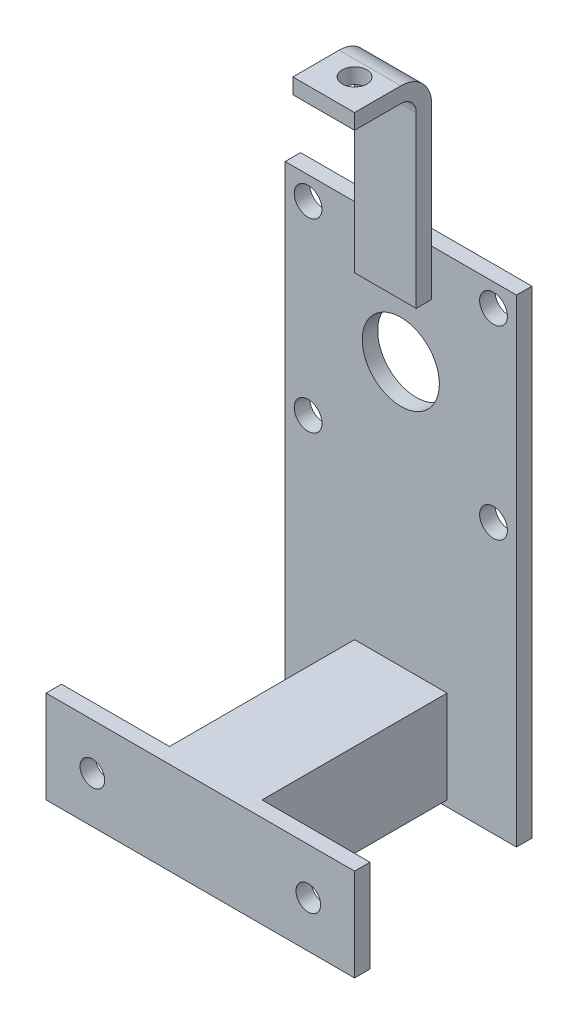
ISO-10303-21;
HEADER;
FILE_DESCRIPTION(('STEP AP214'),'2;1');
FILE_NAME('part.step','',(''),(''),'','','');
FILE_SCHEMA(('AUTOMOTIVE_DESIGN { 1 0 10303 214 1 1 1 1 }'));
ENDSEC;
DATA;
#1=APPLICATION_CONTEXT('core data for automotive mechanical design processes');
#2=APPLICATION_PROTOCOL_DEFINITION('international standard','automotive_design',2000,#1);
#3=PRODUCT_CONTEXT('',#1,'mechanical');
#4=PRODUCT('Part','Part','',(#3));
#5=PRODUCT_RELATED_PRODUCT_CATEGORY('part','',(#4));
#6=PRODUCT_DEFINITION_FORMATION('','',#4);
#7=PRODUCT_DEFINITION_CONTEXT('part definition',#1,'design');
#8=PRODUCT_DEFINITION('design','',#6,#7);
#9=PRODUCT_DEFINITION_SHAPE('','',#8);
#10=(LENGTH_UNIT() NAMED_UNIT(*) SI_UNIT(.MILLI.,.METRE.));
#11=(NAMED_UNIT(*) PLANE_ANGLE_UNIT() SI_UNIT($,.RADIAN.));
#12=(NAMED_UNIT(*) SI_UNIT($,.STERADIAN.) SOLID_ANGLE_UNIT());
#13=UNCERTAINTY_MEASURE_WITH_UNIT(LENGTH_MEASURE(1.E-05),#10,'distance_accuracy_value','');
#14=(GEOMETRIC_REPRESENTATION_CONTEXT(3) GLOBAL_UNCERTAINTY_ASSIGNED_CONTEXT((#13)) GLOBAL_UNIT_ASSIGNED_CONTEXT((#10,
#11,#12)) REPRESENTATION_CONTEXT('',''));
#15=CARTESIAN_POINT('',(0.,0.,0.));
#16=DIRECTION('',(0.,0.,1.));
#17=DIRECTION('',(1.,0.,0.));
#18=AXIS2_PLACEMENT_3D('',#15,#16,#17);
#19=CARTESIAN_POINT('',(0.,155.,5.));
#20=DIRECTION('',(0.,0.,-1.));
#21=DIRECTION('',(-1.,0.,0.));
#22=AXIS2_PLACEMENT_3D('',#19,#20,#21);
#23=PLANE('',#22);
#24=CARTESIAN_POINT('',(37.5,117.5,5.));
#25=DIRECTION('',(0.,0.,1.));
#26=DIRECTION('',(1.,0.,0.));
#27=AXIS2_PLACEMENT_3D('',#24,#25,#26);
#28=CIRCLE('',#27,12.5);
#29=CARTESIAN_POINT('',(50.,117.5,5.));
#30=VERTEX_POINT('',#29);
#31=EDGE_CURVE('E494',#30,#30,#28,.T.);
#32=ORIENTED_EDGE('',*,*,#31,.F.);
#33=EDGE_LOOP('',(#32));
#34=FACE_BOUND('',#33,.T.);
#35=CARTESIAN_POINT('',(67.5520382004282,147.552038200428,5.));
#36=DIRECTION('',(0.,0.,1.));
#37=DIRECTION('',(1.,0.,0.));
#38=AXIS2_PLACEMENT_3D('',#35,#36,#37);
#39=CIRCLE('',#38,4.50000000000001);
#40=CARTESIAN_POINT('',(72.0520382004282,147.552038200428,5.));
#41=VERTEX_POINT('',#40);
#42=EDGE_CURVE('E629',#41,#41,#39,.T.);
#43=ORIENTED_EDGE('',*,*,#42,.F.);
#44=EDGE_LOOP('',(#43));
#45=FACE_BOUND('',#44,.T.);
#46=CARTESIAN_POINT('',(7.44796179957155,147.552038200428,5.));
#47=DIRECTION('',(0.,0.,1.));
#48=DIRECTION('',(0.,1.,0.));
#49=AXIS2_PLACEMENT_3D('',#46,#47,#48);
#50=CIRCLE('',#49,4.50000000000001);
#51=CARTESIAN_POINT('',(7.44796179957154,152.052038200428,5.));
#52=VERTEX_POINT('',#51);
#53=EDGE_CURVE('E625',#52,#52,#50,.T.);
#54=ORIENTED_EDGE('',*,*,#53,.F.);
#55=EDGE_LOOP('',(#54));
#56=FACE_BOUND('',#55,.T.);
#57=CARTESIAN_POINT('',(7.44796179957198,87.4479617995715,5.));
#58=DIRECTION('',(0.,0.,1.));
#59=DIRECTION('',(-1.,0.,0.));
#60=AXIS2_PLACEMENT_3D('',#57,#58,#59);
#61=CIRCLE('',#60,4.50000000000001);
#62=CARTESIAN_POINT('',(2.94796179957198,87.4479617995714,5.));
#63=VERTEX_POINT('',#62);
#64=EDGE_CURVE('E621',#63,#63,#61,.T.);
#65=ORIENTED_EDGE('',*,*,#64,.F.);
#66=EDGE_LOOP('',(#65));
#67=FACE_BOUND('',#66,.T.);
#68=CARTESIAN_POINT('',(67.5520382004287,87.4479617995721,5.));
#69=DIRECTION('',(0.,0.,1.));
#70=DIRECTION('',(0.,-1.,0.));
#71=AXIS2_PLACEMENT_3D('',#68,#69,#70);
#72=CIRCLE('',#71,4.50000000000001);
#73=CARTESIAN_POINT('',(67.5520382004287,82.9479617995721,5.));
#74=VERTEX_POINT('',#73);
#75=EDGE_CURVE('E613',#74,#74,#72,.T.);
#76=ORIENTED_EDGE('',*,*,#75,.F.);
#77=EDGE_LOOP('',(#76));
#78=FACE_BOUND('',#77,.T.);
#79=DIRECTION('',(0.,1.,0.));
#80=VECTOR('',#79,1.);
#81=CARTESIAN_POINT('',(47.5,140.,5.));
#82=LINE('',#81,#80);
#83=CARTESIAN_POINT('',(47.5,140.,5.));
#84=VERTEX_POINT('',#83);
#85=CARTESIAN_POINT('',(47.5,155.,5.));
#86=VERTEX_POINT('',#85);
#87=EDGE_CURVE('E573',#84,#86,#82,.T.);
#88=ORIENTED_EDGE('',*,*,#87,.F.);
#89=DIRECTION('',(1.,0.,0.));
#90=VECTOR('',#89,1.);
#91=CARTESIAN_POINT('',(47.5,140.,5.));
#92=LINE('',#91,#90);
#93=CARTESIAN_POINT('',(27.5,140.,5.));
#94=VERTEX_POINT('',#93);
#95=EDGE_CURVE('E528',#94,#84,#92,.T.);
#96=ORIENTED_EDGE('',*,*,#95,.F.);
#97=DIRECTION('',(0.,-1.,0.));
#98=VECTOR('',#97,1.);
#99=CARTESIAN_POINT('',(27.5,140.,5.));
#100=LINE('',#99,#98);
#101=CARTESIAN_POINT('',(27.5,155.,5.));
#102=VERTEX_POINT('',#101);
#103=EDGE_CURVE('E522',#102,#94,#100,.T.);
#104=ORIENTED_EDGE('',*,*,#103,.F.);
#105=DIRECTION('',(-1.,0.,0.));
#106=VECTOR('',#105,1.);
#107=CARTESIAN_POINT('',(0.,155.,5.));
#108=LINE('',#107,#106);
#109=CARTESIAN_POINT('',(0.,155.,5.));
#110=VERTEX_POINT('',#109);
#111=EDGE_CURVE('E507',#102,#110,#108,.T.);
#112=ORIENTED_EDGE('',*,*,#111,.T.);
#113=DIRECTION('',(0.,-1.,0.));
#114=VECTOR('',#113,1.);
#115=CARTESIAN_POINT('',(0.,0.,5.));
#116=LINE('',#115,#114);
#117=CARTESIAN_POINT('',(0.,0.,5.));
#118=VERTEX_POINT('',#117);
#119=EDGE_CURVE('E500',#110,#118,#116,.T.);
#120=ORIENTED_EDGE('',*,*,#119,.T.);
#121=DIRECTION('',(1.,0.,0.));
#122=VECTOR('',#121,1.);
#123=CARTESIAN_POINT('',(0.,0.,5.));
#124=LINE('',#123,#122);
#125=CARTESIAN_POINT('',(75.,0.,5.));
#126=VERTEX_POINT('',#125);
#127=EDGE_CURVE('E503',#118,#126,#124,.T.);
#128=ORIENTED_EDGE('',*,*,#127,.T.);
#129=DIRECTION('',(0.,1.,0.));
#130=VECTOR('',#129,1.);
#131=CARTESIAN_POINT('',(75.,0.,5.));
#132=LINE('',#131,#130);
#133=CARTESIAN_POINT('',(75.,155.,5.));
#134=VERTEX_POINT('',#133);
#135=EDGE_CURVE('E505',#126,#134,#132,.T.);
#136=ORIENTED_EDGE('',*,*,#135,.T.);
#137=EDGE_CURVE('E508',#134,#86,#108,.T.);
#138=ORIENTED_EDGE('',*,*,#137,.T.);
#139=EDGE_LOOP('',(#88,#96,#104,#112,#120,#128,#136,#138));
#140=FACE_BOUND('',#139,.T.);
#141=DIRECTION('',(0.,-1.,0.));
#142=VECTOR('',#141,1.);
#143=CARTESIAN_POINT('',(22.5,32.,5.));
#144=LINE('',#143,#142);
#145=CARTESIAN_POINT('',(22.5,32.,5.));
#146=VERTEX_POINT('',#145);
#147=CARTESIAN_POINT('',(22.5,2.,5.));
#148=VERTEX_POINT('',#147);
#149=EDGE_CURVE('E351',#146,#148,#144,.T.);
#150=ORIENTED_EDGE('',*,*,#149,.F.);
#151=DIRECTION('',(-1.,0.,0.));
#152=VECTOR('',#151,1.);
#153=CARTESIAN_POINT('',(22.5,32.,5.));
#154=LINE('',#153,#152);
#155=CARTESIAN_POINT('',(52.5,32.,5.));
#156=VERTEX_POINT('',#155);
#157=EDGE_CURVE('E356',#156,#146,#154,.T.);
#158=ORIENTED_EDGE('',*,*,#157,.F.);
#159=DIRECTION('',(0.,1.,0.));
#160=VECTOR('',#159,1.);
#161=CARTESIAN_POINT('',(52.5,32.,5.));
#162=LINE('',#161,#160);
#163=CARTESIAN_POINT('',(52.5,2.,5.));
#164=VERTEX_POINT('',#163);
#165=EDGE_CURVE('E48',#164,#156,#162,.T.);
#166=ORIENTED_EDGE('',*,*,#165,.F.);
#167=DIRECTION('',(1.,0.,0.));
#168=VECTOR('',#167,1.);
#169=CARTESIAN_POINT('',(22.5,2.,5.));
#170=LINE('',#169,#168);
#171=EDGE_CURVE('E43',#148,#164,#170,.T.);
#172=ORIENTED_EDGE('',*,*,#171,.F.);
#173=EDGE_LOOP('',(#150,#158,#166,#172));
#174=FACE_BOUND('',#173,.T.);
#175=ADVANCED_FACE('F25',(#34,#45,#56,#67,#78,#140,#174),#23,.F.);
#176=CARTESIAN_POINT('',(0.,0.,5.));
#177=DIRECTION('',(1.,0.,0.));
#178=DIRECTION('',(0.,0.,-1.));
#179=AXIS2_PLACEMENT_3D('',#176,#177,#178);
#180=PLANE('',#179);
#181=DIRECTION('',(0.,-1.,0.));
#182=VECTOR('',#181,1.);
#183=CARTESIAN_POINT('',(0.,0.,0.));
#184=LINE('',#183,#182);
#185=CARTESIAN_POINT('',(0.,155.,0.));
#186=VERTEX_POINT('',#185);
#187=CARTESIAN_POINT('',(0.,0.,0.));
#188=VERTEX_POINT('',#187);
#189=EDGE_CURVE('E484',#186,#188,#184,.T.);
#190=ORIENTED_EDGE('',*,*,#189,.T.);
#191=DIRECTION('',(0.,0.,-1.));
#192=VECTOR('',#191,1.);
#193=CARTESIAN_POINT('',(0.,0.,5.));
#194=LINE('',#193,#192);
#195=EDGE_CURVE('E520',#118,#188,#194,.T.);
#196=ORIENTED_EDGE('',*,*,#195,.F.);
#197=ORIENTED_EDGE('',*,*,#119,.F.);
#198=DIRECTION('',(0.,0.,-1.));
#199=VECTOR('',#198,1.);
#200=CARTESIAN_POINT('',(0.,155.,5.));
#201=LINE('',#200,#199);
#202=EDGE_CURVE('E511',#110,#186,#201,.T.);
#203=ORIENTED_EDGE('',*,*,#202,.T.);
#204=EDGE_LOOP('',(#190,#196,#197,#203));
#205=FACE_BOUND('',#204,.T.);
#206=ADVANCED_FACE('F27',(#205),#180,.F.);
#207=CARTESIAN_POINT('',(0.,0.,5.));
#208=DIRECTION('',(0.,1.,0.));
#209=DIRECTION('',(0.,0.,1.));
#210=AXIS2_PLACEMENT_3D('',#207,#208,#209);
#211=PLANE('',#210);
#212=DIRECTION('',(1.,0.,0.));
#213=VECTOR('',#212,1.);
#214=CARTESIAN_POINT('',(0.,0.,0.));
#215=LINE('',#214,#213);
#216=CARTESIAN_POINT('',(75.,0.,0.));
#217=VERTEX_POINT('',#216);
#218=EDGE_CURVE('E487',#188,#217,#215,.T.);
#219=ORIENTED_EDGE('',*,*,#218,.T.);
#220=DIRECTION('',(0.,0.,-1.));
#221=VECTOR('',#220,1.);
#222=CARTESIAN_POINT('',(75.,0.,5.));
#223=LINE('',#222,#221);
#224=EDGE_CURVE('E517',#126,#217,#223,.T.);
#225=ORIENTED_EDGE('',*,*,#224,.F.);
#226=ORIENTED_EDGE('',*,*,#127,.F.);
#227=ORIENTED_EDGE('',*,*,#195,.T.);
#228=EDGE_LOOP('',(#219,#225,#226,#227));
#229=FACE_BOUND('',#228,.T.);
#230=ADVANCED_FACE('F298',(#229),#211,.F.);
#231=CARTESIAN_POINT('',(75.,0.,5.));
#232=DIRECTION('',(-1.,0.,0.));
#233=DIRECTION('',(0.,0.,1.));
#234=AXIS2_PLACEMENT_3D('',#231,#232,#233);
#235=PLANE('',#234);
#236=DIRECTION('',(0.,1.,0.));
#237=VECTOR('',#236,1.);
#238=CARTESIAN_POINT('',(75.,0.,0.));
#239=LINE('',#238,#237);
#240=CARTESIAN_POINT('',(75.,155.,0.));
#241=VERTEX_POINT('',#240);
#242=EDGE_CURVE('E492',#217,#241,#239,.T.);
#243=ORIENTED_EDGE('',*,*,#242,.T.);
#244=DIRECTION('',(0.,0.,-1.));
#245=VECTOR('',#244,1.);
#246=CARTESIAN_POINT('',(75.,155.,5.));
#247=LINE('',#246,#245);
#248=EDGE_CURVE('E514',#134,#241,#247,.T.);
#249=ORIENTED_EDGE('',*,*,#248,.F.);
#250=ORIENTED_EDGE('',*,*,#135,.F.);
#251=ORIENTED_EDGE('',*,*,#224,.T.);
#252=EDGE_LOOP('',(#243,#249,#250,#251));
#253=FACE_BOUND('',#252,.T.);
#254=ADVANCED_FACE('F459',(#253),#235,.F.);
#255=CARTESIAN_POINT('',(0.,155.,5.));
#256=DIRECTION('',(0.,-1.,0.));
#257=DIRECTION('',(0.,0.,-1.));
#258=AXIS2_PLACEMENT_3D('',#255,#256,#257);
#259=PLANE('',#258);
#260=DIRECTION('',(-1.,0.,0.));
#261=VECTOR('',#260,1.);
#262=CARTESIAN_POINT('',(0.,155.,0.));
#263=LINE('',#262,#261);
#264=EDGE_CURVE('E486',#241,#186,#263,.T.);
#265=ORIENTED_EDGE('',*,*,#264,.T.);
#266=ORIENTED_EDGE('',*,*,#202,.F.);
#267=ORIENTED_EDGE('',*,*,#111,.F.);
#268=EDGE_CURVE('E512',#86,#102,#108,.T.);
#269=ORIENTED_EDGE('',*,*,#268,.F.);
#270=ORIENTED_EDGE('',*,*,#137,.F.);
#271=ORIENTED_EDGE('',*,*,#248,.T.);
#272=EDGE_LOOP('',(#265,#266,#267,#269,#270,#271));
#273=FACE_BOUND('',#272,.T.);
#274=ADVANCED_FACE('F454',(#273),#259,.F.);
#275=CARTESIAN_POINT('',(0.,155.,0.));
#276=DIRECTION('',(0.,0.,-1.));
#277=DIRECTION('',(-1.,0.,0.));
#278=AXIS2_PLACEMENT_3D('',#275,#276,#277);
#279=PLANE('',#278);
#280=CARTESIAN_POINT('',(67.5520382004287,87.4479617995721,0.));
#281=DIRECTION('',(0.,0.,1.));
#282=DIRECTION('',(0.,-1.,0.));
#283=AXIS2_PLACEMENT_3D('',#280,#281,#282);
#284=CIRCLE('',#283,4.50000000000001);
#285=CARTESIAN_POINT('',(67.5520382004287,82.9479617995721,0.));
#286=VERTEX_POINT('',#285);
#287=EDGE_CURVE('E464',#286,#286,#284,.T.);
#288=ORIENTED_EDGE('',*,*,#287,.T.);
#289=EDGE_LOOP('',(#288));
#290=FACE_BOUND('',#289,.T.);
#291=CARTESIAN_POINT('',(7.44796179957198,87.4479617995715,0.));
#292=DIRECTION('',(0.,0.,1.));
#293=DIRECTION('',(-1.,0.,0.));
#294=AXIS2_PLACEMENT_3D('',#291,#292,#293);
#295=CIRCLE('',#294,4.50000000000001);
#296=CARTESIAN_POINT('',(2.94796179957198,87.4479617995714,0.));
#297=VERTEX_POINT('',#296);
#298=EDGE_CURVE('E468',#297,#297,#295,.T.);
#299=ORIENTED_EDGE('',*,*,#298,.T.);
#300=EDGE_LOOP('',(#299));
#301=FACE_BOUND('',#300,.T.);
#302=CARTESIAN_POINT('',(7.44796179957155,147.552038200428,0.));
#303=DIRECTION('',(0.,0.,1.));
#304=DIRECTION('',(0.,1.,0.));
#305=AXIS2_PLACEMENT_3D('',#302,#303,#304);
#306=CIRCLE('',#305,4.50000000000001);
#307=CARTESIAN_POINT('',(7.44796179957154,152.052038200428,0.));
#308=VERTEX_POINT('',#307);
#309=EDGE_CURVE('E472',#308,#308,#306,.T.);
#310=ORIENTED_EDGE('',*,*,#309,.T.);
#311=EDGE_LOOP('',(#310));
#312=FACE_BOUND('',#311,.T.);
#313=CARTESIAN_POINT('',(67.5520382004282,147.552038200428,0.));
#314=DIRECTION('',(0.,0.,1.));
#315=DIRECTION('',(1.,0.,0.));
#316=AXIS2_PLACEMENT_3D('',#313,#314,#315);
#317=CIRCLE('',#316,4.50000000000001);
#318=CARTESIAN_POINT('',(72.0520382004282,147.552038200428,0.));
#319=VERTEX_POINT('',#318);
#320=EDGE_CURVE('E476',#319,#319,#317,.T.);
#321=ORIENTED_EDGE('',*,*,#320,.T.);
#322=EDGE_LOOP('',(#321));
#323=FACE_BOUND('',#322,.T.);
#324=CARTESIAN_POINT('',(37.5,117.5,0.));
#325=DIRECTION('',(0.,0.,1.));
#326=DIRECTION('',(1.,0.,0.));
#327=AXIS2_PLACEMENT_3D('',#324,#325,#326);
#328=CIRCLE('',#327,12.5);
#329=CARTESIAN_POINT('',(50.,117.5,0.));
#330=VERTEX_POINT('',#329);
#331=EDGE_CURVE('E480',#330,#330,#328,.T.);
#332=ORIENTED_EDGE('',*,*,#331,.T.);
#333=EDGE_LOOP('',(#332));
#334=FACE_BOUND('',#333,.T.);
#335=ORIENTED_EDGE('',*,*,#189,.F.);
#336=ORIENTED_EDGE('',*,*,#264,.F.);
#337=ORIENTED_EDGE('',*,*,#242,.F.);
#338=ORIENTED_EDGE('',*,*,#218,.F.);
#339=EDGE_LOOP('',(#335,#336,#337,#338));
#340=FACE_BOUND('',#339,.T.);
#341=ADVANCED_FACE('F451',(#290,#301,#312,#323,#334,#340),#279,.T.);
#342=CARTESIAN_POINT('',(37.5,117.5,0.));
#343=DIRECTION('',(0.,0.,1.));
#344=DIRECTION('',(1.,0.,0.));
#345=AXIS2_PLACEMENT_3D('',#342,#343,#344);
#346=CYLINDRICAL_SURFACE('',#345,12.5);
#347=ORIENTED_EDGE('',*,*,#331,.F.);
#348=EDGE_LOOP('',(#347));
#349=FACE_BOUND('',#348,.T.);
#350=ORIENTED_EDGE('',*,*,#31,.T.);
#351=EDGE_LOOP('',(#350));
#352=FACE_BOUND('',#351,.T.);
#353=ADVANCED_FACE('F448',(#349,#352),#346,.F.);
#354=CARTESIAN_POINT('',(67.5520382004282,147.552038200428,0.));
#355=DIRECTION('',(0.,0.,1.));
#356=DIRECTION('',(1.,0.,0.));
#357=AXIS2_PLACEMENT_3D('',#354,#355,#356);
#358=CYLINDRICAL_SURFACE('',#357,4.50000000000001);
#359=ORIENTED_EDGE('',*,*,#320,.F.);
#360=EDGE_LOOP('',(#359));
#361=FACE_BOUND('',#360,.T.);
#362=ORIENTED_EDGE('',*,*,#42,.T.);
#363=EDGE_LOOP('',(#362));
#364=FACE_BOUND('',#363,.T.);
#365=ADVANCED_FACE('F444',(#361,#364),#358,.F.);
#366=CARTESIAN_POINT('',(7.44796179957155,147.552038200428,0.));
#367=DIRECTION('',(0.,0.,1.));
#368=DIRECTION('',(1.,0.,0.));
#369=AXIS2_PLACEMENT_3D('',#366,#367,#368);
#370=CYLINDRICAL_SURFACE('',#369,4.50000000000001);
#371=ORIENTED_EDGE('',*,*,#309,.F.);
#372=EDGE_LOOP('',(#371));
#373=FACE_BOUND('',#372,.T.);
#374=ORIENTED_EDGE('',*,*,#53,.T.);
#375=EDGE_LOOP('',(#374));
#376=FACE_BOUND('',#375,.T.);
#377=ADVANCED_FACE('F440',(#373,#376),#370,.F.);
#378=CARTESIAN_POINT('',(7.44796179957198,87.4479617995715,0.));
#379=DIRECTION('',(0.,0.,1.));
#380=DIRECTION('',(1.,0.,0.));
#381=AXIS2_PLACEMENT_3D('',#378,#379,#380);
#382=CYLINDRICAL_SURFACE('',#381,4.50000000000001);
#383=ORIENTED_EDGE('',*,*,#298,.F.);
#384=EDGE_LOOP('',(#383));
#385=FACE_BOUND('',#384,.T.);
#386=ORIENTED_EDGE('',*,*,#64,.T.);
#387=EDGE_LOOP('',(#386));
#388=FACE_BOUND('',#387,.T.);
#389=ADVANCED_FACE('F436',(#385,#388),#382,.F.);
#390=CARTESIAN_POINT('',(67.5520382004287,87.4479617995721,0.));
#391=DIRECTION('',(0.,0.,1.));
#392=DIRECTION('',(1.,0.,0.));
#393=AXIS2_PLACEMENT_3D('',#390,#391,#392);
#394=CYLINDRICAL_SURFACE('',#393,4.50000000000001);
#395=ORIENTED_EDGE('',*,*,#287,.F.);
#396=EDGE_LOOP('',(#395));
#397=FACE_BOUND('',#396,.T.);
#398=ORIENTED_EDGE('',*,*,#75,.T.);
#399=EDGE_LOOP('',(#398));
#400=FACE_BOUND('',#399,.T.);
#401=ADVANCED_FACE('F414',(#397,#400),#394,.F.);
#402=CARTESIAN_POINT('',(47.5,205.,5.));
#403=DIRECTION('',(0.,0.,1.));
#404=DIRECTION('',(1.,0.,0.));
#405=AXIS2_PLACEMENT_3D('',#402,#403,#404);
#406=PLANE('',#405);
#407=CARTESIAN_POINT('',(27.5,195.,5.));
#408=VERTEX_POINT('',#407);
#409=EDGE_CURVE('E575',#408,#102,#100,.T.);
#410=ORIENTED_EDGE('',*,*,#409,.F.);
#411=DIRECTION('',(-1.,0.,0.));
#412=VECTOR('',#411,1.);
#413=CARTESIAN_POINT('',(47.5,195.,5.));
#414=LINE('',#413,#412);
#415=CARTESIAN_POINT('',(47.5,195.,5.));
#416=VERTEX_POINT('',#415);
#417=EDGE_CURVE('E35',#408,#416,#414,.F.);
#418=ORIENTED_EDGE('',*,*,#417,.T.);
#419=EDGE_CURVE('E576',#86,#416,#82,.T.);
#420=ORIENTED_EDGE('',*,*,#419,.F.);
#421=ORIENTED_EDGE('',*,*,#268,.T.);
#422=EDGE_LOOP('',(#410,#418,#420,#421));
#423=FACE_BOUND('',#422,.T.);
#424=ADVANCED_FACE('F410',(#423),#406,.F.);
#425=CARTESIAN_POINT('',(47.5,140.,10.));
#426=DIRECTION('',(-1.,0.,0.));
#427=DIRECTION('',(0.,0.,1.));
#428=AXIS2_PLACEMENT_3D('',#425,#426,#427);
#429=PLANE('',#428);
#430=ORIENTED_EDGE('',*,*,#419,.T.);
#431=CARTESIAN_POINT('',(47.5,195.,15.));
#432=DIRECTION('',(-1.,0.,0.));
#433=DIRECTION('',(0.,0.,1.));
#434=AXIS2_PLACEMENT_3D('',#431,#432,#433);
#435=CIRCLE('',#434,10.);
#436=CARTESIAN_POINT('',(47.5,205.,15.));
#437=VERTEX_POINT('',#436);
#438=EDGE_CURVE('E11',#416,#437,#435,.F.);
#439=ORIENTED_EDGE('',*,*,#438,.T.);
#440=DIRECTION('',(0.,0.,-1.));
#441=VECTOR('',#440,1.);
#442=CARTESIAN_POINT('',(47.5,205.,10.));
#443=LINE('',#442,#441);
#444=CARTESIAN_POINT('',(47.5,205.,30.));
#445=VERTEX_POINT('',#444);
#446=EDGE_CURVE('E609',#445,#437,#443,.T.);
#447=ORIENTED_EDGE('',*,*,#446,.F.);
#448=DIRECTION('',(0.,1.,0.));
#449=VECTOR('',#448,1.);
#450=CARTESIAN_POINT('',(47.5,205.,30.));
#451=LINE('',#450,#449);
#452=CARTESIAN_POINT('',(47.5,200.,30.));
#453=VERTEX_POINT('',#452);
#454=EDGE_CURVE('E567',#453,#445,#451,.T.);
#455=ORIENTED_EDGE('',*,*,#454,.F.);
#456=DIRECTION('',(0.,0.,-1.));
#457=VECTOR('',#456,1.);
#458=CARTESIAN_POINT('',(47.5,200.,30.));
#459=LINE('',#458,#457);
#460=CARTESIAN_POINT('',(47.5,200.,15.));
#461=VERTEX_POINT('',#460);
#462=EDGE_CURVE('E529',#453,#461,#459,.T.);
#463=ORIENTED_EDGE('',*,*,#462,.T.);
#464=CARTESIAN_POINT('',(47.5,195.,15.));
#465=DIRECTION('',(-1.,0.,0.));
#466=DIRECTION('',(0.,0.,1.));
#467=AXIS2_PLACEMENT_3D('',#464,#465,#466);
#468=CIRCLE('',#467,5.);
#469=CARTESIAN_POINT('',(47.5,195.,10.));
#470=VERTEX_POINT('',#469);
#471=EDGE_CURVE('E546',#461,#470,#468,.T.);
#472=ORIENTED_EDGE('',*,*,#471,.T.);
#473=DIRECTION('',(0.,1.,0.));
#474=VECTOR('',#473,1.);
#475=CARTESIAN_POINT('',(47.5,140.,10.));
#476=LINE('',#475,#474);
#477=CARTESIAN_POINT('',(47.5,140.,10.));
#478=VERTEX_POINT('',#477);
#479=EDGE_CURVE('E523',#478,#470,#476,.T.);
#480=ORIENTED_EDGE('',*,*,#479,.F.);
#481=DIRECTION('',(0.,0.,-1.));
#482=VECTOR('',#481,1.);
#483=CARTESIAN_POINT('',(47.5,140.,10.));
#484=LINE('',#483,#482);
#485=EDGE_CURVE('E615',#478,#84,#484,.T.);
#486=ORIENTED_EDGE('',*,*,#485,.T.);
#487=ORIENTED_EDGE('',*,*,#87,.T.);
#488=EDGE_LOOP('',(#430,#439,#447,#455,#463,#472,#480,#486,#487));
#489=FACE_BOUND('',#488,.T.);
#490=ADVANCED_FACE('F413',(#489),#429,.F.);
#491=CARTESIAN_POINT('',(47.5,205.,10.));
#492=DIRECTION('',(0.,-1.,0.));
#493=DIRECTION('',(0.,0.,-1.));
#494=AXIS2_PLACEMENT_3D('',#491,#492,#493);
#495=PLANE('',#494);
#496=CARTESIAN_POINT('',(37.5,205.,20.));
#497=DIRECTION('',(0.,1.,0.));
#498=DIRECTION('',(0.,0.,1.));
#499=AXIS2_PLACEMENT_3D('',#496,#497,#498);
#500=CIRCLE('',#499,4.);
#501=CARTESIAN_POINT('',(37.5,205.,24.));
#502=VERTEX_POINT('',#501);
#503=EDGE_CURVE('E369',#502,#502,#500,.T.);
#504=ORIENTED_EDGE('',*,*,#503,.F.);
#505=EDGE_LOOP('',(#504));
#506=FACE_BOUND('',#505,.T.);
#507=ORIENTED_EDGE('',*,*,#446,.T.);
#508=DIRECTION('',(-1.,0.,0.));
#509=VECTOR('',#508,1.);
#510=CARTESIAN_POINT('',(47.5,205.,15.));
#511=LINE('',#510,#509);
#512=CARTESIAN_POINT('',(27.5,205.,15.));
#513=VERTEX_POINT('',#512);
#514=EDGE_CURVE('E550',#437,#513,#511,.T.);
#515=ORIENTED_EDGE('',*,*,#514,.T.);
#516=DIRECTION('',(0.,0.,-1.));
#517=VECTOR('',#516,1.);
#518=CARTESIAN_POINT('',(27.5,205.,10.));
#519=LINE('',#518,#517);
#520=CARTESIAN_POINT('',(27.5,205.,30.));
#521=VERTEX_POINT('',#520);
#522=EDGE_CURVE('E608',#521,#513,#519,.T.);
#523=ORIENTED_EDGE('',*,*,#522,.F.);
#524=DIRECTION('',(-1.,0.,0.));
#525=VECTOR('',#524,1.);
#526=CARTESIAN_POINT('',(27.5,205.,30.));
#527=LINE('',#526,#525);
#528=EDGE_CURVE('E570',#445,#521,#527,.T.);
#529=ORIENTED_EDGE('',*,*,#528,.F.);
#530=EDGE_LOOP('',(#507,#515,#523,#529));
#531=FACE_BOUND('',#530,.T.);
#532=ADVANCED_FACE('F426',(#506,#531),#495,.F.);
#533=CARTESIAN_POINT('',(27.5,140.,10.));
#534=DIRECTION('',(1.,0.,0.));
#535=DIRECTION('',(0.,0.,-1.));
#536=AXIS2_PLACEMENT_3D('',#533,#534,#535);
#537=PLANE('',#536);
#538=ORIENTED_EDGE('',*,*,#522,.T.);
#539=CARTESIAN_POINT('',(27.5,195.,15.));
#540=DIRECTION('',(1.,0.,0.));
#541=DIRECTION('',(0.,0.,-1.));
#542=AXIS2_PLACEMENT_3D('',#539,#540,#541);
#543=CIRCLE('',#542,10.);
#544=EDGE_CURVE('E553',#513,#408,#543,.F.);
#545=ORIENTED_EDGE('',*,*,#544,.T.);
#546=ORIENTED_EDGE('',*,*,#409,.T.);
#547=ORIENTED_EDGE('',*,*,#103,.T.);
#548=DIRECTION('',(0.,0.,-1.));
#549=VECTOR('',#548,1.);
#550=CARTESIAN_POINT('',(27.5,140.,10.));
#551=LINE('',#550,#549);
#552=CARTESIAN_POINT('',(27.5,140.,10.));
#553=VERTEX_POINT('',#552);
#554=EDGE_CURVE('E611',#553,#94,#551,.T.);
#555=ORIENTED_EDGE('',*,*,#554,.F.);
#556=DIRECTION('',(0.,-1.,0.));
#557=VECTOR('',#556,1.);
#558=CARTESIAN_POINT('',(27.5,140.,10.));
#559=LINE('',#558,#557);
#560=CARTESIAN_POINT('',(27.5,195.,10.));
#561=VERTEX_POINT('',#560);
#562=EDGE_CURVE('E527',#561,#553,#559,.T.);
#563=ORIENTED_EDGE('',*,*,#562,.F.);
#564=CARTESIAN_POINT('',(27.5,195.,15.));
#565=DIRECTION('',(1.,0.,0.));
#566=DIRECTION('',(0.,0.,-1.));
#567=AXIS2_PLACEMENT_3D('',#564,#565,#566);
#568=CIRCLE('',#567,5.);
#569=CARTESIAN_POINT('',(27.5,200.,15.));
#570=VERTEX_POINT('',#569);
#571=EDGE_CURVE('E548',#561,#570,#568,.T.);
#572=ORIENTED_EDGE('',*,*,#571,.T.);
#573=DIRECTION('',(0.,0.,-1.));
#574=VECTOR('',#573,1.);
#575=CARTESIAN_POINT('',(27.5,200.,30.));
#576=LINE('',#575,#574);
#577=CARTESIAN_POINT('',(27.5,200.,30.));
#578=VERTEX_POINT('',#577);
#579=EDGE_CURVE('E591',#578,#570,#576,.T.);
#580=ORIENTED_EDGE('',*,*,#579,.F.);
#581=DIRECTION('',(0.,-1.,0.));
#582=VECTOR('',#581,1.);
#583=CARTESIAN_POINT('',(27.5,205.,30.));
#584=LINE('',#583,#582);
#585=EDGE_CURVE('E558',#521,#578,#584,.T.);
#586=ORIENTED_EDGE('',*,*,#585,.F.);
#587=EDGE_LOOP('',(#538,#545,#546,#547,#555,#563,#572,#580,#586));
#588=FACE_BOUND('',#587,.T.);
#589=ADVANCED_FACE('F422',(#588),#537,.F.);
#590=CARTESIAN_POINT('',(47.5,140.,10.));
#591=DIRECTION('',(0.,1.,0.));
#592=DIRECTION('',(0.,0.,1.));
#593=AXIS2_PLACEMENT_3D('',#590,#591,#592);
#594=PLANE('',#593);
#595=ORIENTED_EDGE('',*,*,#95,.T.);
#596=ORIENTED_EDGE('',*,*,#485,.F.);
#597=DIRECTION('',(1.,0.,0.));
#598=VECTOR('',#597,1.);
#599=CARTESIAN_POINT('',(47.5,140.,10.));
#600=LINE('',#599,#598);
#601=EDGE_CURVE('E537',#553,#478,#600,.T.);
#602=ORIENTED_EDGE('',*,*,#601,.F.);
#603=ORIENTED_EDGE('',*,*,#554,.T.);
#604=EDGE_LOOP('',(#595,#596,#602,#603));
#605=FACE_BOUND('',#604,.T.);
#606=ADVANCED_FACE('F418',(#605),#594,.F.);
#607=CARTESIAN_POINT('',(47.5,205.,10.));
#608=DIRECTION('',(0.,0.,1.));
#609=DIRECTION('',(1.,0.,0.));
#610=AXIS2_PLACEMENT_3D('',#607,#608,#609);
#611=PLANE('',#610);
#612=ORIENTED_EDGE('',*,*,#479,.T.);
#613=DIRECTION('',(1.,0.,0.));
#614=VECTOR('',#613,1.);
#615=CARTESIAN_POINT('',(47.5,195.,10.));
#616=LINE('',#615,#614);
#617=EDGE_CURVE('E544',#470,#561,#616,.F.);
#618=ORIENTED_EDGE('',*,*,#617,.T.);
#619=ORIENTED_EDGE('',*,*,#562,.T.);
#620=ORIENTED_EDGE('',*,*,#601,.T.);
#621=EDGE_LOOP('',(#612,#618,#619,#620));
#622=FACE_BOUND('',#621,.T.);
#623=ADVANCED_FACE('F408',(#622),#611,.T.);
#624=CARTESIAN_POINT('',(27.5,200.,30.));
#625=DIRECTION('',(0.,1.,0.));
#626=DIRECTION('',(0.,0.,1.));
#627=AXIS2_PLACEMENT_3D('',#624,#625,#626);
#628=PLANE('',#627);
#629=CARTESIAN_POINT('',(37.5,200.,20.));
#630=DIRECTION('',(0.,1.,0.));
#631=DIRECTION('',(0.,0.,1.));
#632=AXIS2_PLACEMENT_3D('',#629,#630,#631);
#633=CIRCLE('',#632,3.99999999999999);
#634=CARTESIAN_POINT('',(37.5,200.,24.));
#635=VERTEX_POINT('',#634);
#636=EDGE_CURVE('E556',#635,#635,#633,.T.);
#637=ORIENTED_EDGE('',*,*,#636,.T.);
#638=EDGE_LOOP('',(#637));
#639=FACE_BOUND('',#638,.T.);
#640=ORIENTED_EDGE('',*,*,#579,.T.);
#641=DIRECTION('',(1.,0.,0.));
#642=VECTOR('',#641,1.);
#643=CARTESIAN_POINT('',(27.5,200.,15.));
#644=LINE('',#643,#642);
#645=EDGE_CURVE('E542',#570,#461,#644,.T.);
#646=ORIENTED_EDGE('',*,*,#645,.T.);
#647=ORIENTED_EDGE('',*,*,#462,.F.);
#648=DIRECTION('',(1.,0.,0.));
#649=VECTOR('',#648,1.);
#650=CARTESIAN_POINT('',(27.5,200.,30.));
#651=LINE('',#650,#649);
#652=EDGE_CURVE('E561',#578,#453,#651,.T.);
#653=ORIENTED_EDGE('',*,*,#652,.F.);
#654=EDGE_LOOP('',(#640,#646,#647,#653));
#655=FACE_BOUND('',#654,.T.);
#656=ADVANCED_FACE('F404',(#639,#655),#628,.F.);
#657=CARTESIAN_POINT('',(27.5,200.,30.));
#658=DIRECTION('',(0.,0.,1.));
#659=DIRECTION('',(1.,0.,0.));
#660=AXIS2_PLACEMENT_3D('',#657,#658,#659);
#661=PLANE('',#660);
#662=ORIENTED_EDGE('',*,*,#585,.T.);
#663=ORIENTED_EDGE('',*,*,#652,.T.);
#664=ORIENTED_EDGE('',*,*,#454,.T.);
#665=ORIENTED_EDGE('',*,*,#528,.T.);
#666=EDGE_LOOP('',(#662,#663,#664,#665));
#667=FACE_BOUND('',#666,.T.);
#668=ADVANCED_FACE('F400',(#667),#661,.T.);
#669=CARTESIAN_POINT('',(27.5,195.,15.));
#670=DIRECTION('',(1.,0.,0.));
#671=DIRECTION('',(0.,0.,-1.));
#672=AXIS2_PLACEMENT_3D('',#669,#670,#671);
#673=CYLINDRICAL_SURFACE('',#672,5.);
#674=ORIENTED_EDGE('',*,*,#571,.F.);
#675=ORIENTED_EDGE('',*,*,#617,.F.);
#676=ORIENTED_EDGE('',*,*,#471,.F.);
#677=ORIENTED_EDGE('',*,*,#645,.F.);
#678=EDGE_LOOP('',(#674,#675,#676,#677));
#679=FACE_BOUND('',#678,.T.);
#680=ADVANCED_FACE('F396',(#679),#673,.F.);
#681=CARTESIAN_POINT('',(47.5,195.,15.));
#682=DIRECTION('',(-1.,0.,0.));
#683=DIRECTION('',(0.,0.,1.));
#684=AXIS2_PLACEMENT_3D('',#681,#682,#683);
#685=CYLINDRICAL_SURFACE('',#684,10.);
#686=ORIENTED_EDGE('',*,*,#438,.F.);
#687=ORIENTED_EDGE('',*,*,#417,.F.);
#688=ORIENTED_EDGE('',*,*,#544,.F.);
#689=ORIENTED_EDGE('',*,*,#514,.F.);
#690=EDGE_LOOP('',(#686,#687,#688,#689));
#691=FACE_BOUND('',#690,.T.);
#692=ADVANCED_FACE('F389',(#691),#685,.T.);
#693=CARTESIAN_POINT('',(37.5,205.,20.));
#694=DIRECTION('',(0.,1.,0.));
#695=DIRECTION('',(0.,0.,1.));
#696=AXIS2_PLACEMENT_3D('',#693,#694,#695);
#697=CYLINDRICAL_SURFACE('',#696,3.99999999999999);
#698=ORIENTED_EDGE('',*,*,#503,.T.);
#699=EDGE_LOOP('',(#698));
#700=FACE_BOUND('',#699,.T.);
#701=ORIENTED_EDGE('',*,*,#636,.F.);
#702=EDGE_LOOP('',(#701));
#703=FACE_BOUND('',#702,.T.);
#704=ADVANCED_FACE('F383',(#700,#703),#697,.F.);
#705=CARTESIAN_POINT('',(22.5,32.,65.));
#706=DIRECTION('',(1.,0.,0.));
#707=DIRECTION('',(0.,1.,0.));
#708=AXIS2_PLACEMENT_3D('',#705,#706,#707);
#709=PLANE('',#708);
#710=ORIENTED_EDGE('',*,*,#149,.T.);
#711=DIRECTION('',(0.,0.,-1.));
#712=VECTOR('',#711,1.);
#713=CARTESIAN_POINT('',(22.5,2.,65.));
#714=LINE('',#713,#712);
#715=CARTESIAN_POINT('',(22.5,2.,65.));
#716=VERTEX_POINT('',#715);
#717=EDGE_CURVE('E367',#716,#148,#714,.T.);
#718=ORIENTED_EDGE('',*,*,#717,.F.);
#719=DIRECTION('',(0.,-1.,0.));
#720=VECTOR('',#719,1.);
#721=CARTESIAN_POINT('',(22.5,32.,65.));
#722=LINE('',#721,#720);
#723=CARTESIAN_POINT('',(22.5,32.,65.));
#724=VERTEX_POINT('',#723);
#725=EDGE_CURVE('E200',#724,#716,#722,.T.);
#726=ORIENTED_EDGE('',*,*,#725,.F.);
#727=DIRECTION('',(0.,0.,-1.));
#728=VECTOR('',#727,1.);
#729=CARTESIAN_POINT('',(22.5,32.,65.));
#730=LINE('',#729,#728);
#731=EDGE_CURVE('E372',#724,#146,#730,.T.);
#732=ORIENTED_EDGE('',*,*,#731,.T.);
#733=EDGE_LOOP('',(#710,#718,#726,#732));
#734=FACE_BOUND('',#733,.T.);
#735=ADVANCED_FACE('F382',(#734),#709,.F.);
#736=CARTESIAN_POINT('',(22.5,2.,65.));
#737=DIRECTION('',(0.,1.,0.));
#738=DIRECTION('',(0.,0.,1.));
#739=AXIS2_PLACEMENT_3D('',#736,#737,#738);
#740=PLANE('',#739);
#741=ORIENTED_EDGE('',*,*,#171,.T.);
#742=DIRECTION('',(0.,0.,-1.));
#743=VECTOR('',#742,1.);
#744=CARTESIAN_POINT('',(52.5,2.,65.));
#745=LINE('',#744,#743);
#746=CARTESIAN_POINT('',(52.5,2.,65.));
#747=VERTEX_POINT('',#746);
#748=EDGE_CURVE('E370',#747,#164,#745,.T.);
#749=ORIENTED_EDGE('',*,*,#748,.F.);
#750=DIRECTION('',(1.,0.,0.));
#751=VECTOR('',#750,1.);
#752=CARTESIAN_POINT('',(-12.5,2.,65.));
#753=LINE('',#752,#751);
#754=CARTESIAN_POINT('',(87.5,2.,65.));
#755=VERTEX_POINT('',#754);
#756=EDGE_CURVE('E203',#747,#755,#753,.T.);
#757=ORIENTED_EDGE('',*,*,#756,.T.);
#758=DIRECTION('',(0.,0.,-1.));
#759=VECTOR('',#758,1.);
#760=CARTESIAN_POINT('',(87.5,2.,70.));
#761=LINE('',#760,#759);
#762=CARTESIAN_POINT('',(87.5,2.,70.));
#763=VERTEX_POINT('',#762);
#764=EDGE_CURVE('E214',#763,#755,#761,.T.);
#765=ORIENTED_EDGE('',*,*,#764,.F.);
#766=DIRECTION('',(1.,0.,0.));
#767=VECTOR('',#766,1.);
#768=CARTESIAN_POINT('',(-12.5,2.,70.));
#769=LINE('',#768,#767);
#770=CARTESIAN_POINT('',(-12.5,2.,70.));
#771=VERTEX_POINT('',#770);
#772=EDGE_CURVE('E209',#771,#763,#769,.T.);
#773=ORIENTED_EDGE('',*,*,#772,.F.);
#774=DIRECTION('',(0.,0.,-1.));
#775=VECTOR('',#774,1.);
#776=CARTESIAN_POINT('',(-12.5,2.,70.));
#777=LINE('',#776,#775);
#778=CARTESIAN_POINT('',(-12.5,2.,65.));
#779=VERTEX_POINT('',#778);
#780=EDGE_CURVE('E206',#771,#779,#777,.T.);
#781=ORIENTED_EDGE('',*,*,#780,.T.);
#782=EDGE_CURVE('E193',#779,#716,#753,.T.);
#783=ORIENTED_EDGE('',*,*,#782,.T.);
#784=ORIENTED_EDGE('',*,*,#717,.T.);
#785=EDGE_LOOP('',(#741,#749,#757,#765,#773,#781,#783,#784));
#786=FACE_BOUND('',#785,.T.);
#787=ADVANCED_FACE('F207',(#786),#740,.F.);
#788=CARTESIAN_POINT('',(52.5,32.,65.));
#789=DIRECTION('',(-1.,0.,0.));
#790=DIRECTION('',(0.,-1.,0.));
#791=AXIS2_PLACEMENT_3D('',#788,#789,#790);
#792=PLANE('',#791);
#793=ORIENTED_EDGE('',*,*,#165,.T.);
#794=DIRECTION('',(0.,0.,-1.));
#795=VECTOR('',#794,1.);
#796=CARTESIAN_POINT('',(52.5,32.,65.));
#797=LINE('',#796,#795);
#798=CARTESIAN_POINT('',(52.5,32.,65.));
#799=VERTEX_POINT('',#798);
#800=EDGE_CURVE('E269',#799,#156,#797,.T.);
#801=ORIENTED_EDGE('',*,*,#800,.F.);
#802=DIRECTION('',(0.,1.,0.));
#803=VECTOR('',#802,1.);
#804=CARTESIAN_POINT('',(52.5,32.,65.));
#805=LINE('',#804,#803);
#806=EDGE_CURVE('E264',#747,#799,#805,.T.);
#807=ORIENTED_EDGE('',*,*,#806,.F.);
#808=ORIENTED_EDGE('',*,*,#748,.T.);
#809=EDGE_LOOP('',(#793,#801,#807,#808));
#810=FACE_BOUND('',#809,.T.);
#811=ADVANCED_FACE('F381',(#810),#792,.F.);
#812=CARTESIAN_POINT('',(22.5,32.,65.));
#813=DIRECTION('',(0.,-1.,0.));
#814=DIRECTION('',(0.,0.,-1.));
#815=AXIS2_PLACEMENT_3D('',#812,#813,#814);
#816=PLANE('',#815);
#817=ORIENTED_EDGE('',*,*,#157,.T.);
#818=ORIENTED_EDGE('',*,*,#731,.F.);
#819=DIRECTION('',(-1.,0.,0.));
#820=VECTOR('',#819,1.);
#821=CARTESIAN_POINT('',(-12.5,32.,65.));
#822=LINE('',#821,#820);
#823=CARTESIAN_POINT('',(-12.5,32.,65.));
#824=VERTEX_POINT('',#823);
#825=EDGE_CURVE('E234',#724,#824,#822,.T.);
#826=ORIENTED_EDGE('',*,*,#825,.T.);
#827=DIRECTION('',(0.,0.,-1.));
#828=VECTOR('',#827,1.);
#829=CARTESIAN_POINT('',(-12.5,32.,70.));
#830=LINE('',#829,#828);
#831=CARTESIAN_POINT('',(-12.5,32.,70.));
#832=VERTEX_POINT('',#831);
#833=EDGE_CURVE('E219',#832,#824,#830,.T.);
#834=ORIENTED_EDGE('',*,*,#833,.F.);
#835=DIRECTION('',(-1.,0.,0.));
#836=VECTOR('',#835,1.);
#837=CARTESIAN_POINT('',(-12.5,32.,70.));
#838=LINE('',#837,#836);
#839=CARTESIAN_POINT('',(87.5,32.,70.));
#840=VERTEX_POINT('',#839);
#841=EDGE_CURVE('E245',#840,#832,#838,.T.);
#842=ORIENTED_EDGE('',*,*,#841,.F.);
#843=DIRECTION('',(0.,0.,-1.));
#844=VECTOR('',#843,1.);
#845=CARTESIAN_POINT('',(87.5,32.,70.));
#846=LINE('',#845,#844);
#847=CARTESIAN_POINT('',(87.5,32.,65.));
#848=VERTEX_POINT('',#847);
#849=EDGE_CURVE('E248',#840,#848,#846,.T.);
#850=ORIENTED_EDGE('',*,*,#849,.T.);
#851=EDGE_CURVE('E236',#848,#799,#822,.T.);
#852=ORIENTED_EDGE('',*,*,#851,.T.);
#853=ORIENTED_EDGE('',*,*,#800,.T.);
#854=EDGE_LOOP('',(#817,#818,#826,#834,#842,#850,#852,#853));
#855=FACE_BOUND('',#854,.T.);
#856=ADVANCED_FACE('F268',(#855),#816,.F.);
#857=CARTESIAN_POINT('',(-12.5,2.,65.));
#858=DIRECTION('',(0.,0.,1.));
#859=DIRECTION('',(1.,0.,0.));
#860=AXIS2_PLACEMENT_3D('',#857,#858,#859);
#861=PLANE('',#860);
#862=CARTESIAN_POINT('',(2.49999999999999,17.,65.));
#863=DIRECTION('',(0.,0.,1.));
#864=DIRECTION('',(1.,0.,0.));
#865=AXIS2_PLACEMENT_3D('',#862,#863,#864);
#866=CIRCLE('',#865,3.99999999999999);
#867=CARTESIAN_POINT('',(6.49999999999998,17.,65.));
#868=VERTEX_POINT('',#867);
#869=EDGE_CURVE('E844',#868,#868,#866,.T.);
#870=ORIENTED_EDGE('',*,*,#869,.T.);
#871=EDGE_LOOP('',(#870));
#872=FACE_BOUND('',#871,.T.);
#873=ORIENTED_EDGE('',*,*,#825,.F.);
#874=ORIENTED_EDGE('',*,*,#725,.T.);
#875=ORIENTED_EDGE('',*,*,#782,.F.);
#876=DIRECTION('',(0.,-1.,0.));
#877=VECTOR('',#876,1.);
#878=CARTESIAN_POINT('',(-12.5,32.,65.));
#879=LINE('',#878,#877);
#880=EDGE_CURVE('E198',#824,#779,#879,.T.);
#881=ORIENTED_EDGE('',*,*,#880,.F.);
#882=EDGE_LOOP('',(#873,#874,#875,#881));
#883=FACE_BOUND('',#882,.T.);
#884=ADVANCED_FACE('F196',(#872,#883),#861,.F.);
#885=CARTESIAN_POINT('',(72.5,17.,65.));
#886=DIRECTION('',(0.,0.,1.));
#887=DIRECTION('',(1.,0.,0.));
#888=AXIS2_PLACEMENT_3D('',#885,#886,#887);
#889=CIRCLE('',#888,3.99999999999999);
#890=CARTESIAN_POINT('',(76.5,17.,65.));
#891=VERTEX_POINT('',#890);
#892=EDGE_CURVE('E220',#891,#891,#889,.T.);
#893=ORIENTED_EDGE('',*,*,#892,.T.);
#894=EDGE_LOOP('',(#893));
#895=FACE_BOUND('',#894,.T.);
#896=ORIENTED_EDGE('',*,*,#756,.F.);
#897=ORIENTED_EDGE('',*,*,#806,.T.);
#898=ORIENTED_EDGE('',*,*,#851,.F.);
#899=DIRECTION('',(0.,1.,0.));
#900=VECTOR('',#899,1.);
#901=CARTESIAN_POINT('',(87.5,32.,65.));
#902=LINE('',#901,#900);
#903=EDGE_CURVE('E202',#755,#848,#902,.T.);
#904=ORIENTED_EDGE('',*,*,#903,.F.);
#905=EDGE_LOOP('',(#896,#897,#898,#904));
#906=FACE_BOUND('',#905,.T.);
#907=ADVANCED_FACE('F260',(#895,#906),#861,.F.);
#908=CARTESIAN_POINT('',(-12.5,32.,70.));
#909=DIRECTION('',(1.,0.,0.));
#910=DIRECTION('',(0.,1.,0.));
#911=AXIS2_PLACEMENT_3D('',#908,#909,#910);
#912=PLANE('',#911);
#913=ORIENTED_EDGE('',*,*,#880,.T.);
#914=ORIENTED_EDGE('',*,*,#780,.F.);
#915=DIRECTION('',(0.,-1.,0.));
#916=VECTOR('',#915,1.);
#917=CARTESIAN_POINT('',(-12.5,32.,70.));
#918=LINE('',#917,#916);
#919=EDGE_CURVE('E239',#832,#771,#918,.T.);
#920=ORIENTED_EDGE('',*,*,#919,.F.);
#921=ORIENTED_EDGE('',*,*,#833,.T.);
#922=EDGE_LOOP('',(#913,#914,#920,#921));
#923=FACE_BOUND('',#922,.T.);
#924=ADVANCED_FACE('F217',(#923),#912,.F.);
#925=CARTESIAN_POINT('',(87.5,32.,70.));
#926=DIRECTION('',(-1.,0.,0.));
#927=DIRECTION('',(0.,0.,1.));
#928=AXIS2_PLACEMENT_3D('',#925,#926,#927);
#929=PLANE('',#928);
#930=ORIENTED_EDGE('',*,*,#903,.T.);
#931=ORIENTED_EDGE('',*,*,#849,.F.);
#932=DIRECTION('',(0.,1.,0.));
#933=VECTOR('',#932,1.);
#934=CARTESIAN_POINT('',(87.5,32.,70.));
#935=LINE('',#934,#933);
#936=EDGE_CURVE('E243',#763,#840,#935,.T.);
#937=ORIENTED_EDGE('',*,*,#936,.F.);
#938=ORIENTED_EDGE('',*,*,#764,.T.);
#939=EDGE_LOOP('',(#930,#931,#937,#938));
#940=FACE_BOUND('',#939,.T.);
#941=ADVANCED_FACE('F255',(#940),#929,.F.);
#942=CARTESIAN_POINT('',(-12.5,2.,70.));
#943=DIRECTION('',(0.,0.,1.));
#944=DIRECTION('',(1.,0.,0.));
#945=AXIS2_PLACEMENT_3D('',#942,#943,#944);
#946=PLANE('',#945);
#947=CARTESIAN_POINT('',(2.49999999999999,17.,70.));
#948=DIRECTION('',(0.,0.,1.));
#949=DIRECTION('',(1.,0.,0.));
#950=AXIS2_PLACEMENT_3D('',#947,#948,#949);
#951=CIRCLE('',#950,3.99999999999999);
#952=CARTESIAN_POINT('',(6.49999999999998,17.,70.));
#953=VERTEX_POINT('',#952);
#954=EDGE_CURVE('E841',#953,#953,#951,.T.);
#955=ORIENTED_EDGE('',*,*,#954,.F.);
#956=EDGE_LOOP('',(#955));
#957=FACE_BOUND('',#956,.T.);
#958=CARTESIAN_POINT('',(72.5,17.,70.));
#959=DIRECTION('',(0.,0.,1.));
#960=DIRECTION('',(1.,0.,0.));
#961=AXIS2_PLACEMENT_3D('',#958,#959,#960);
#962=CIRCLE('',#961,3.99999999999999);
#963=CARTESIAN_POINT('',(76.5,17.,70.));
#964=VERTEX_POINT('',#963);
#965=EDGE_CURVE('E224',#964,#964,#962,.T.);
#966=ORIENTED_EDGE('',*,*,#965,.F.);
#967=EDGE_LOOP('',(#966));
#968=FACE_BOUND('',#967,.T.);
#969=ORIENTED_EDGE('',*,*,#919,.T.);
#970=ORIENTED_EDGE('',*,*,#772,.T.);
#971=ORIENTED_EDGE('',*,*,#936,.T.);
#972=ORIENTED_EDGE('',*,*,#841,.T.);
#973=EDGE_LOOP('',(#969,#970,#971,#972));
#974=FACE_BOUND('',#973,.T.);
#975=ADVANCED_FACE('F272',(#957,#968,#974),#946,.T.);
#976=CARTESIAN_POINT('',(72.5,17.,70.));
#977=DIRECTION('',(0.,0.,1.));
#978=DIRECTION('',(1.,0.,0.));
#979=AXIS2_PLACEMENT_3D('',#976,#977,#978);
#980=CYLINDRICAL_SURFACE('',#979,3.99999999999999);
#981=ORIENTED_EDGE('',*,*,#965,.T.);
#982=EDGE_LOOP('',(#981));
#983=FACE_BOUND('',#982,.T.);
#984=ORIENTED_EDGE('',*,*,#892,.F.);
#985=EDGE_LOOP('',(#984));
#986=FACE_BOUND('',#985,.T.);
#987=ADVANCED_FACE('F274',(#983,#986),#980,.F.);
#988=CARTESIAN_POINT('',(2.49999999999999,17.,70.));
#989=DIRECTION('',(0.,0.,1.));
#990=DIRECTION('',(1.,0.,0.));
#991=AXIS2_PLACEMENT_3D('',#988,#989,#990);
#992=CYLINDRICAL_SURFACE('',#991,3.99999999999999);
#993=ORIENTED_EDGE('',*,*,#954,.T.);
#994=EDGE_LOOP('',(#993));
#995=FACE_BOUND('',#994,.T.);
#996=ORIENTED_EDGE('',*,*,#869,.F.);
#997=EDGE_LOOP('',(#996));
#998=FACE_BOUND('',#997,.T.);
#999=ADVANCED_FACE('F281',(#995,#998),#992,.F.);
#1000=CLOSED_SHELL('',(#175,#206,#230,#254,#274,#341,#353,#365,#377,#389,#401,#424,#490,#532,
#589,#606,#623,#656,#668,#680,#692,#704,#735,#787,#811,#856,#884,#907,#924,#941,#975,#987,#999));
#1001=DIRECTION('',(-1.,0.,0.));
#1002=VECTOR('',#1001,1.);
#1003=CARTESIAN_POINT('',(24.5,30.,5.));
#1004=LINE('',#1003,#1002);
#1005=CARTESIAN_POINT('',(50.5,30.,5.));
#1006=VERTEX_POINT('',#1005);
#1007=CARTESIAN_POINT('',(24.5,30.,5.));
#1008=VERTEX_POINT('',#1007);
#1009=EDGE_CURVE('E318',#1006,#1008,#1004,.T.);
#1010=ORIENTED_EDGE('',*,*,#1009,.T.);
#1011=DIRECTION('',(0.,-1.,0.));
#1012=VECTOR('',#1011,1.);
#1013=CARTESIAN_POINT('',(24.5,30.,5.));
#1014=LINE('',#1013,#1012);
#1015=CARTESIAN_POINT('',(24.5,4.,5.));
#1016=VERTEX_POINT('',#1015);
#1017=EDGE_CURVE('E213',#1008,#1016,#1014,.T.);
#1018=ORIENTED_EDGE('',*,*,#1017,.T.);
#1019=DIRECTION('',(1.,0.,0.));
#1020=VECTOR('',#1019,1.);
#1021=CARTESIAN_POINT('',(24.5,4.,5.));
#1022=LINE('',#1021,#1020);
#1023=CARTESIAN_POINT('',(50.5,4.,5.));
#1024=VERTEX_POINT('',#1023);
#1025=EDGE_CURVE('E330',#1016,#1024,#1022,.T.);
#1026=ORIENTED_EDGE('',*,*,#1025,.T.);
#1027=DIRECTION('',(0.,1.,0.));
#1028=VECTOR('',#1027,1.);
#1029=CARTESIAN_POINT('',(50.5,30.,5.));
#1030=LINE('',#1029,#1028);
#1031=EDGE_CURVE('E322',#1024,#1006,#1030,.T.);
#1032=ORIENTED_EDGE('',*,*,#1031,.T.);
#1033=EDGE_LOOP('',(#1010,#1018,#1026,#1032));
#1034=FACE_BOUND('',#1033,.T.);
#1035=ADVANCED_FACE('F292',(#1034),#23,.F.);
#1036=CARTESIAN_POINT('',(50.5,30.,65.));
#1037=DIRECTION('',(-1.,0.,0.));
#1038=DIRECTION('',(0.,-1.,0.));
#1039=AXIS2_PLACEMENT_3D('',#1036,#1037,#1038);
#1040=PLANE('',#1039);
#1041=ORIENTED_EDGE('',*,*,#1031,.F.);
#1042=DIRECTION('',(0.,0.,-1.));
#1043=VECTOR('',#1042,1.);
#1044=CARTESIAN_POINT('',(50.5,4.,65.));
#1045=LINE('',#1044,#1043);
#1046=CARTESIAN_POINT('',(50.5,4.,65.));
#1047=VERTEX_POINT('',#1046);
#1048=EDGE_CURVE('E346',#1047,#1024,#1045,.T.);
#1049=ORIENTED_EDGE('',*,*,#1048,.F.);
#1050=DIRECTION('',(0.,1.,0.));
#1051=VECTOR('',#1050,1.);
#1052=CARTESIAN_POINT('',(50.5,30.,65.));
#1053=LINE('',#1052,#1051);
#1054=CARTESIAN_POINT('',(50.5,30.,65.));
#1055=VERTEX_POINT('',#1054);
#1056=EDGE_CURVE('E336',#1047,#1055,#1053,.T.);
#1057=ORIENTED_EDGE('',*,*,#1056,.T.);
#1058=DIRECTION('',(0.,0.,-1.));
#1059=VECTOR('',#1058,1.);
#1060=CARTESIAN_POINT('',(50.5,30.,65.));
#1061=LINE('',#1060,#1059);
#1062=EDGE_CURVE('E344',#1055,#1006,#1061,.T.);
#1063=ORIENTED_EDGE('',*,*,#1062,.T.);
#1064=EDGE_LOOP('',(#1041,#1049,#1057,#1063));
#1065=FACE_BOUND('',#1064,.T.);
#1066=ADVANCED_FACE('F304',(#1065),#1040,.T.);
#1067=CARTESIAN_POINT('',(24.5,30.,65.));
#1068=DIRECTION('',(0.,-1.,0.));
#1069=DIRECTION('',(0.,0.,-1.));
#1070=AXIS2_PLACEMENT_3D('',#1067,#1068,#1069);
#1071=PLANE('',#1070);
#1072=ORIENTED_EDGE('',*,*,#1009,.F.);
#1073=ORIENTED_EDGE('',*,*,#1062,.F.);
#1074=DIRECTION('',(-1.,0.,0.));
#1075=VECTOR('',#1074,1.);
#1076=CARTESIAN_POINT('',(24.5,30.,65.));
#1077=LINE('',#1076,#1075);
#1078=CARTESIAN_POINT('',(24.5,30.,65.));
#1079=VERTEX_POINT('',#1078);
#1080=EDGE_CURVE('E339',#1055,#1079,#1077,.T.);
#1081=ORIENTED_EDGE('',*,*,#1080,.T.);
#1082=DIRECTION('',(0.,0.,-1.));
#1083=VECTOR('',#1082,1.);
#1084=CARTESIAN_POINT('',(24.5,30.,65.));
#1085=LINE('',#1084,#1083);
#1086=EDGE_CURVE('E342',#1079,#1008,#1085,.T.);
#1087=ORIENTED_EDGE('',*,*,#1086,.T.);
#1088=EDGE_LOOP('',(#1072,#1073,#1081,#1087));
#1089=FACE_BOUND('',#1088,.T.);
#1090=ADVANCED_FACE('F311',(#1089),#1071,.T.);
#1091=CARTESIAN_POINT('',(24.5,30.,65.));
#1092=DIRECTION('',(1.,0.,0.));
#1093=DIRECTION('',(0.,1.,0.));
#1094=AXIS2_PLACEMENT_3D('',#1091,#1092,#1093);
#1095=PLANE('',#1094);
#1096=ORIENTED_EDGE('',*,*,#1017,.F.);
#1097=ORIENTED_EDGE('',*,*,#1086,.F.);
#1098=DIRECTION('',(0.,-1.,0.));
#1099=VECTOR('',#1098,1.);
#1100=CARTESIAN_POINT('',(24.5,30.,65.));
#1101=LINE('',#1100,#1099);
#1102=CARTESIAN_POINT('',(24.5,4.,65.));
#1103=VERTEX_POINT('',#1102);
#1104=EDGE_CURVE('E325',#1079,#1103,#1101,.T.);
#1105=ORIENTED_EDGE('',*,*,#1104,.T.);
#1106=DIRECTION('',(0.,0.,-1.));
#1107=VECTOR('',#1106,1.);
#1108=CARTESIAN_POINT('',(24.5,4.,65.));
#1109=LINE('',#1108,#1107);
#1110=EDGE_CURVE('E348',#1103,#1016,#1109,.T.);
#1111=ORIENTED_EDGE('',*,*,#1110,.T.);
#1112=EDGE_LOOP('',(#1096,#1097,#1105,#1111));
#1113=FACE_BOUND('',#1112,.T.);
#1114=ADVANCED_FACE('F772',(#1113),#1095,.T.);
#1115=CARTESIAN_POINT('',(24.5,4.,65.));
#1116=DIRECTION('',(0.,1.,0.));
#1117=DIRECTION('',(0.,0.,1.));
#1118=AXIS2_PLACEMENT_3D('',#1115,#1116,#1117);
#1119=PLANE('',#1118);
#1120=ORIENTED_EDGE('',*,*,#1025,.F.);
#1121=ORIENTED_EDGE('',*,*,#1110,.F.);
#1122=DIRECTION('',(1.,0.,0.));
#1123=VECTOR('',#1122,1.);
#1124=CARTESIAN_POINT('',(24.5,4.,65.));
#1125=LINE('',#1124,#1123);
#1126=EDGE_CURVE('E328',#1103,#1047,#1125,.T.);
#1127=ORIENTED_EDGE('',*,*,#1126,.T.);
#1128=ORIENTED_EDGE('',*,*,#1048,.T.);
#1129=EDGE_LOOP('',(#1120,#1121,#1127,#1128));
#1130=FACE_BOUND('',#1129,.T.);
#1131=ADVANCED_FACE('F777',(#1130),#1119,.T.);
#1132=ORIENTED_EDGE('',*,*,#1126,.F.);
#1133=ORIENTED_EDGE('',*,*,#1104,.F.);
#1134=ORIENTED_EDGE('',*,*,#1080,.F.);
#1135=ORIENTED_EDGE('',*,*,#1056,.F.);
#1136=EDGE_LOOP('',(#1132,#1133,#1134,#1135));
#1137=FACE_BOUND('',#1136,.T.);
#1138=ADVANCED_FACE('F786',(#1137),#861,.F.);
#1139=CLOSED_SHELL('',(#1035,#1066,#1090,#1114,#1131,#1138));
#1140=ORIENTED_CLOSED_SHELL('',*,#1139,.T.);
#1141=BREP_WITH_VOIDS('B2',#1000,(#1140));
#1142=ADVANCED_BREP_SHAPE_REPRESENTATION('',(#18,#1141),#14);
#1143=SHAPE_DEFINITION_REPRESENTATION(#9,#1142);
ENDSEC;
END-ISO-10303-21;
